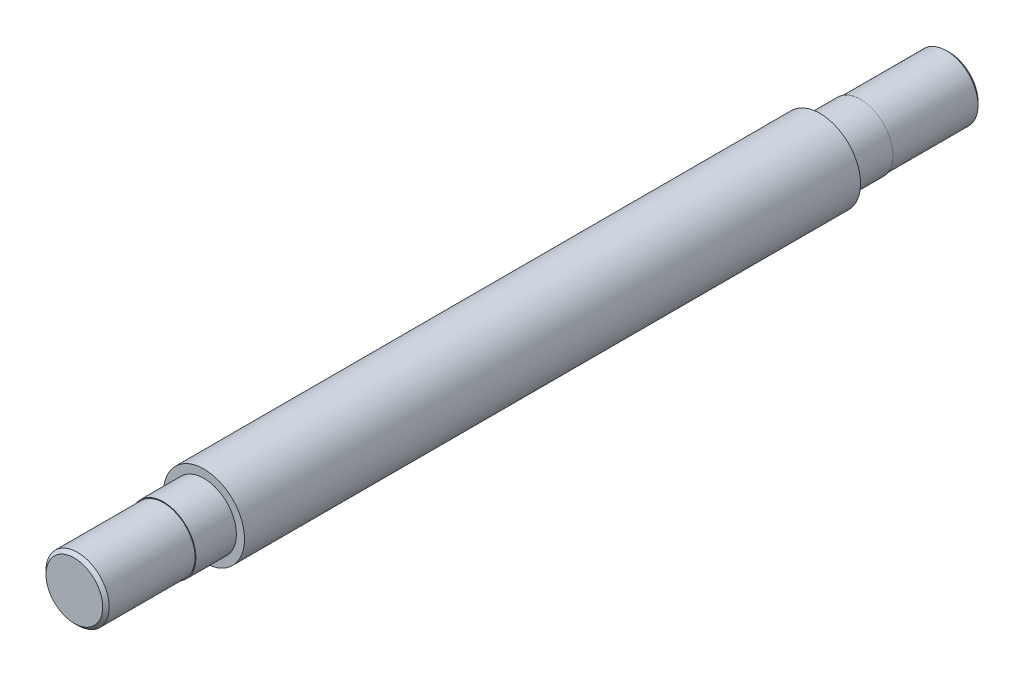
from build123d import *

# Parameters (mm, degrees)
SKETCH_1_R      = 25
EXTRUDE_1_DEPTH = 380
SKETCH_2_R      = 20
EXTRUDE_2_DEPTH = 25
EXTRUDE_START   = 25
SKETCH_3_R      = 20
EXTRUDE_3_DEPTH = 25
SKETCH_4_R      = 19.5
EXTRUDE_4_DEPTH = 55
EXTRUDE_START_2 = 55
SKETCH_5_R      = 19.5
EXTRUDE_5_DEPTH = 55
CHAMFER_1_SIZE  = 2


with BuildPart() as part:
    # Sketch 1 → Extrude 1 (new body)
    with BuildSketch(Plane.XY):
        Circle(SKETCH_1_R)
    extrude(amount=EXTRUDE_1_DEPTH)

    # Sketch 2 → Extrude 2 (add)
    with BuildSketch(Plane.XY.offset(380)):
        Circle(SKETCH_2_R)
    extrude(amount=EXTRUDE_2_DEPTH)

    # Sketch 3 → Extrude 3 (add)
    with BuildSketch(Plane(origin=(0, 0, 0), x_dir=(-1, 0, 0), z_dir=(0, 0, -1)).offset(EXTRUDE_START)):
        with Locations(Location((0, 0, 0), (0, 0, 180))):
            Circle(SKETCH_3_R)
    extrude(amount=-EXTRUDE_3_DEPTH)

    # Sketch 4 → Extrude 4 (add)
    with BuildSketch(Plane.XY.offset(405)):
        Circle(SKETCH_4_R)
    extrude(amount=EXTRUDE_4_DEPTH)

    # Sketch 5 → Extrude 5 (add)
    with BuildSketch(Plane(origin=(0, 0, -25), x_dir=(-1, 0, 0), z_dir=(0, 0, -1)).offset(EXTRUDE_START_2)):
        with Locations(Location((0, 0, 0), (0, 0, 180))):
            Circle(SKETCH_5_R)
    extrude(amount=-EXTRUDE_5_DEPTH)

    # Chamfer 1
    chamfer_1_edges = [part.edges().sort_by_distance(p)[0] for p in [
        (-19.5, 0, 460),
        (-19.5, 0, -80),
    ]]
    chamfer(chamfer_1_edges, length=CHAMFER_1_SIZE)


solid = part.part
